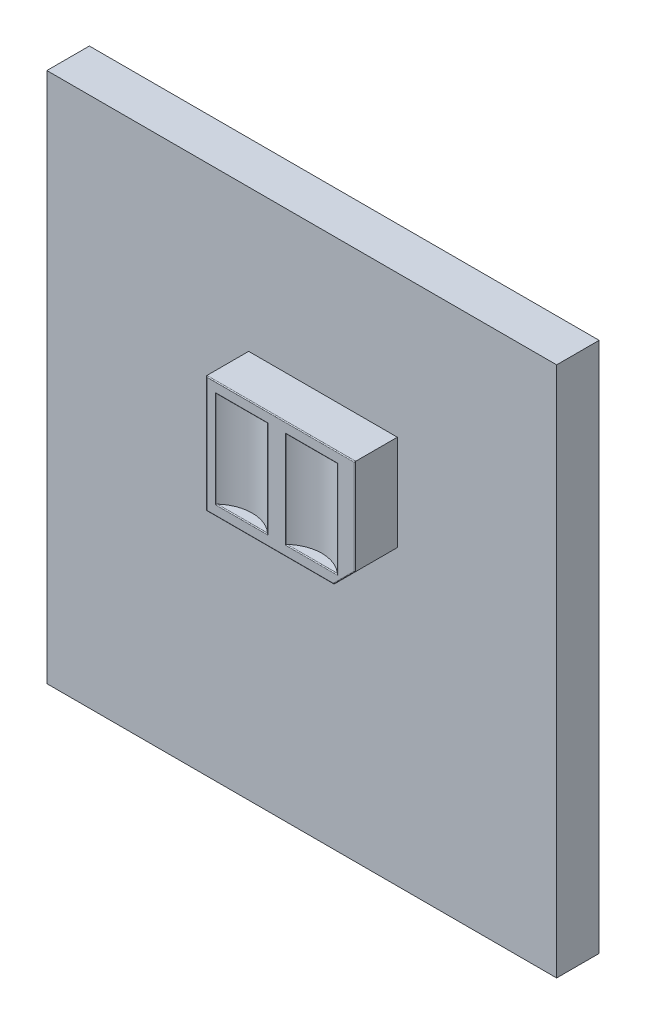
ISO-10303-21;
HEADER;
FILE_DESCRIPTION(('STEP AP214'),'2;1');
FILE_NAME('part.step','',(''),(''),'','','');
FILE_SCHEMA(('AUTOMOTIVE_DESIGN { 1 0 10303 214 1 1 1 1 }'));
ENDSEC;
DATA;
#1=APPLICATION_CONTEXT('core data for automotive mechanical design processes');
#2=APPLICATION_PROTOCOL_DEFINITION('international standard','automotive_design',2000,#1);
#3=PRODUCT_CONTEXT('',#1,'mechanical');
#4=PRODUCT('Part','Part','',(#3));
#5=PRODUCT_RELATED_PRODUCT_CATEGORY('part','',(#4));
#6=PRODUCT_DEFINITION_FORMATION('','',#4);
#7=PRODUCT_DEFINITION_CONTEXT('part definition',#1,'design');
#8=PRODUCT_DEFINITION('design','',#6,#7);
#9=PRODUCT_DEFINITION_SHAPE('','',#8);
#10=(LENGTH_UNIT() NAMED_UNIT(*) SI_UNIT(.MILLI.,.METRE.));
#11=(NAMED_UNIT(*) PLANE_ANGLE_UNIT() SI_UNIT($,.RADIAN.));
#12=(NAMED_UNIT(*) SI_UNIT($,.STERADIAN.) SOLID_ANGLE_UNIT());
#13=UNCERTAINTY_MEASURE_WITH_UNIT(LENGTH_MEASURE(1.E-05),#10,'distance_accuracy_value','');
#14=(GEOMETRIC_REPRESENTATION_CONTEXT(3) GLOBAL_UNCERTAINTY_ASSIGNED_CONTEXT((#13)) GLOBAL_UNIT_ASSIGNED_CONTEXT((#10,
#11,#12)) REPRESENTATION_CONTEXT('',''));
#15=CARTESIAN_POINT('',(0.,0.,0.));
#16=DIRECTION('',(0.,0.,1.));
#17=DIRECTION('',(1.,0.,0.));
#18=AXIS2_PLACEMENT_3D('',#15,#16,#17);
#19=CARTESIAN_POINT('',(-1.25,2.9,2.));
#20=DIRECTION('',(0.,0.,-1.));
#21=DIRECTION('',(-1.,0.,0.));
#22=AXIS2_PLACEMENT_3D('',#19,#20,#21);
#23=PLANE('',#22);
#24=DIRECTION('',(-1.,0.,0.));
#25=VECTOR('',#24,1.);
#26=CARTESIAN_POINT('',(-1.25,0.379999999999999,2.));
#27=LINE('',#26,#25);
#28=CARTESIAN_POINT('',(1.84761869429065,0.379999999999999,2.));
#29=VERTEX_POINT('',#28);
#30=CARTESIAN_POINT('',(0.611456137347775,0.379999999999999,2.));
#31=VERTEX_POINT('',#30);
#32=EDGE_CURVE('E286',#29,#31,#27,.T.);
#33=ORIENTED_EDGE('',*,*,#32,.T.);
#34=DIRECTION('',(0.,-1.,0.));
#35=VECTOR('',#34,1.);
#36=CARTESIAN_POINT('',(0.611456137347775,2.9,2.));
#37=LINE('',#36,#35);
#38=CARTESIAN_POINT('',(0.611456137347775,2.67,2.));
#39=VERTEX_POINT('',#38);
#40=EDGE_CURVE('E288',#31,#39,#37,.F.);
#41=ORIENTED_EDGE('',*,*,#40,.T.);
#42=DIRECTION('',(-1.,0.,0.));
#43=VECTOR('',#42,1.);
#44=CARTESIAN_POINT('',(1.83964288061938,2.67,2.));
#45=LINE('',#44,#43);
#46=CARTESIAN_POINT('',(1.84761869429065,2.67,2.));
#47=VERTEX_POINT('',#46);
#48=EDGE_CURVE('E282',#39,#47,#45,.F.);
#49=ORIENTED_EDGE('',*,*,#48,.T.);
#50=DIRECTION('',(0.,-1.,0.));
#51=VECTOR('',#50,1.);
#52=CARTESIAN_POINT('',(1.84761869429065,2.9,2.));
#53=LINE('',#52,#51);
#54=EDGE_CURVE('E284',#47,#29,#53,.T.);
#55=ORIENTED_EDGE('',*,*,#54,.T.);
#56=EDGE_LOOP('',(#33,#41,#49,#55));
#57=FACE_BOUND('',#56,.T.);
#58=DIRECTION('',(0.,1.,0.));
#59=VECTOR('',#58,1.);
#60=CARTESIAN_POINT('',(2.23,2.9,2.));
#61=LINE('',#60,#59);
#62=CARTESIAN_POINT('',(2.23,0.658284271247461,2.));
#63=VERTEX_POINT('',#62);
#64=CARTESIAN_POINT('',(2.23,2.88,2.));
#65=VERTEX_POINT('',#64);
#66=EDGE_CURVE('E277',#63,#65,#61,.T.);
#67=ORIENTED_EDGE('',*,*,#66,.T.);
#68=DIRECTION('',(-1.,0.,0.));
#69=VECTOR('',#68,1.);
#70=CARTESIAN_POINT('',(-1.25,2.88,2.));
#71=LINE('',#70,#69);
#72=CARTESIAN_POINT('',(-1.23,2.88,2.));
#73=VERTEX_POINT('',#72);
#74=EDGE_CURVE('E279',#65,#73,#71,.T.);
#75=ORIENTED_EDGE('',*,*,#74,.T.);
#76=DIRECTION('',(0.,-1.,0.));
#77=VECTOR('',#76,1.);
#78=CARTESIAN_POINT('',(-1.23,2.9,2.));
#79=LINE('',#78,#77);
#80=CARTESIAN_POINT('',(-1.23,0.169999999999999,2.));
#81=VERTEX_POINT('',#80);
#82=EDGE_CURVE('E271',#73,#81,#79,.T.);
#83=ORIENTED_EDGE('',*,*,#82,.T.);
#84=DIRECTION('',(1.,0.,0.));
#85=VECTOR('',#84,1.);
#86=CARTESIAN_POINT('',(-1.25,0.169999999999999,2.));
#87=LINE('',#86,#85);
#88=CARTESIAN_POINT('',(1.74171572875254,0.17,2.));
#89=VERTEX_POINT('',#88);
#90=EDGE_CURVE('E273',#81,#89,#87,.T.);
#91=ORIENTED_EDGE('',*,*,#90,.T.);
#92=DIRECTION('',(0.707106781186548,0.707106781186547,0.));
#93=VECTOR('',#92,1.);
#94=CARTESIAN_POINT('',(1.61085786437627,0.0391421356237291,2.));
#95=LINE('',#94,#93);
#96=EDGE_CURVE('E275',#89,#63,#95,.T.);
#97=ORIENTED_EDGE('',*,*,#96,.T.);
#98=EDGE_LOOP('',(#67,#75,#83,#91,#97));
#99=FACE_BOUND('',#98,.T.);
#100=DIRECTION('',(0.,-1.,0.));
#101=VECTOR('',#100,1.);
#102=CARTESIAN_POINT('',(0.205356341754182,2.9,2.));
#103=LINE('',#102,#101);
#104=CARTESIAN_POINT('',(0.205356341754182,2.67,2.));
#105=VERTEX_POINT('',#104);
#106=CARTESIAN_POINT('',(0.205356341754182,0.379999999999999,2.));
#107=VERTEX_POINT('',#106);
#108=EDGE_CURVE('E266',#105,#107,#103,.T.);
#109=ORIENTED_EDGE('',*,*,#108,.T.);
#110=DIRECTION('',(-1.,0.,0.));
#111=VECTOR('',#110,1.);
#112=CARTESIAN_POINT('',(-1.02283040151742,0.379999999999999,2.));
#113=LINE('',#112,#111);
#114=CARTESIAN_POINT('',(-1.03080621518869,0.379999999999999,2.));
#115=VERTEX_POINT('',#114);
#116=EDGE_CURVE('E268',#107,#115,#113,.T.);
#117=ORIENTED_EDGE('',*,*,#116,.T.);
#118=DIRECTION('',(0.,-1.,0.));
#119=VECTOR('',#118,1.);
#120=CARTESIAN_POINT('',(-1.03080621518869,2.9,2.));
#121=LINE('',#120,#119);
#122=CARTESIAN_POINT('',(-1.03080621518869,2.67,2.));
#123=VERTEX_POINT('',#122);
#124=EDGE_CURVE('E262',#115,#123,#121,.F.);
#125=ORIENTED_EDGE('',*,*,#124,.T.);
#126=DIRECTION('',(-1.,0.,0.));
#127=VECTOR('',#126,1.);
#128=CARTESIAN_POINT('',(-1.25,2.67,2.));
#129=LINE('',#128,#127);
#130=EDGE_CURVE('E264',#123,#105,#129,.F.);
#131=ORIENTED_EDGE('',*,*,#130,.T.);
#132=EDGE_LOOP('',(#109,#117,#125,#131));
#133=FACE_BOUND('',#132,.T.);
#134=ADVANCED_FACE('F31',(#57,#99,#133),#23,.F.);
#135=CARTESIAN_POINT('',(-6.,6.25,1.));
#136=DIRECTION('',(0.,0.,1.));
#137=DIRECTION('',(1.,0.,0.));
#138=AXIS2_PLACEMENT_3D('',#135,#136,#137);
#139=PLANE('',#138);
#140=DIRECTION('',(0.,-1.,0.));
#141=VECTOR('',#140,1.);
#142=CARTESIAN_POINT('',(-6.,6.25,1.));
#143=LINE('',#142,#141);
#144=CARTESIAN_POINT('',(-6.,6.25,1.));
#145=VERTEX_POINT('',#144);
#146=CARTESIAN_POINT('',(-6.,-6.25,1.));
#147=VERTEX_POINT('',#146);
#148=EDGE_CURVE('E237',#145,#147,#143,.T.);
#149=ORIENTED_EDGE('',*,*,#148,.T.);
#150=DIRECTION('',(1.,0.,0.));
#151=VECTOR('',#150,1.);
#152=CARTESIAN_POINT('',(-6.,-6.25,1.));
#153=LINE('',#152,#151);
#154=CARTESIAN_POINT('',(6.,-6.25,1.));
#155=VERTEX_POINT('',#154);
#156=EDGE_CURVE('E240',#147,#155,#153,.T.);
#157=ORIENTED_EDGE('',*,*,#156,.T.);
#158=DIRECTION('',(0.,1.,0.));
#159=VECTOR('',#158,1.);
#160=CARTESIAN_POINT('',(6.,6.25,1.));
#161=LINE('',#160,#159);
#162=CARTESIAN_POINT('',(6.,6.25,1.));
#163=VERTEX_POINT('',#162);
#164=EDGE_CURVE('E242',#155,#163,#161,.T.);
#165=ORIENTED_EDGE('',*,*,#164,.T.);
#166=DIRECTION('',(-1.,0.,0.));
#167=VECTOR('',#166,1.);
#168=CARTESIAN_POINT('',(-6.,6.25,1.));
#169=LINE('',#168,#167);
#170=EDGE_CURVE('E244',#163,#145,#169,.T.);
#171=ORIENTED_EDGE('',*,*,#170,.T.);
#172=EDGE_LOOP('',(#149,#157,#165,#171));
#173=FACE_BOUND('',#172,.T.);
#174=DIRECTION('',(-1.,0.,0.));
#175=VECTOR('',#174,1.);
#176=CARTESIAN_POINT('',(-6.,0.149999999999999,1.));
#177=LINE('',#176,#175);
#178=CARTESIAN_POINT('',(1.75,0.15,1.));
#179=VERTEX_POINT('',#178);
#180=CARTESIAN_POINT('',(-1.25,0.149999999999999,1.));
#181=VERTEX_POINT('',#180);
#182=EDGE_CURVE('E222',#179,#181,#177,.T.);
#183=ORIENTED_EDGE('',*,*,#182,.T.);
#184=DIRECTION('',(0.,1.,0.));
#185=VECTOR('',#184,1.);
#186=CARTESIAN_POINT('',(-1.25,6.25,1.));
#187=LINE('',#186,#185);
#188=CARTESIAN_POINT('',(-1.25,2.9,1.));
#189=VERTEX_POINT('',#188);
#190=EDGE_CURVE('E199',#181,#189,#187,.T.);
#191=ORIENTED_EDGE('',*,*,#190,.T.);
#192=DIRECTION('',(1.,0.,0.));
#193=VECTOR('',#192,1.);
#194=CARTESIAN_POINT('',(-6.,2.9,1.));
#195=LINE('',#194,#193);
#196=CARTESIAN_POINT('',(2.25,2.9,1.));
#197=VERTEX_POINT('',#196);
#198=EDGE_CURVE('E210',#189,#197,#195,.T.);
#199=ORIENTED_EDGE('',*,*,#198,.T.);
#200=DIRECTION('',(0.,-1.,0.));
#201=VECTOR('',#200,1.);
#202=CARTESIAN_POINT('',(2.25,6.25,1.));
#203=LINE('',#202,#201);
#204=CARTESIAN_POINT('',(2.25,0.65,1.));
#205=VERTEX_POINT('',#204);
#206=EDGE_CURVE('E216',#197,#205,#203,.T.);
#207=ORIENTED_EDGE('',*,*,#206,.T.);
#208=DIRECTION('',(-0.707106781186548,-0.707106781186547,0.));
#209=VECTOR('',#208,1.);
#210=CARTESIAN_POINT('',(0.925,-0.675000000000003,1.));
#211=LINE('',#210,#209);
#212=EDGE_CURVE('E228',#205,#179,#211,.T.);
#213=ORIENTED_EDGE('',*,*,#212,.T.);
#214=EDGE_LOOP('',(#183,#191,#199,#207,#213));
#215=FACE_BOUND('',#214,.T.);
#216=ADVANCED_FACE('F219',(#173,#215),#139,.T.);
#217=CARTESIAN_POINT('',(-6.,6.25,1.));
#218=DIRECTION('',(1.,0.,0.));
#219=DIRECTION('',(0.,1.,0.));
#220=AXIS2_PLACEMENT_3D('',#217,#218,#219);
#221=PLANE('',#220);
#222=DIRECTION('',(0.,-1.,0.));
#223=VECTOR('',#222,1.);
#224=CARTESIAN_POINT('',(-6.,6.25,0.));
#225=LINE('',#224,#223);
#226=CARTESIAN_POINT('',(-6.,6.25,0.));
#227=VERTEX_POINT('',#226);
#228=CARTESIAN_POINT('',(-6.,-6.25,0.));
#229=VERTEX_POINT('',#228);
#230=EDGE_CURVE('E223',#227,#229,#225,.T.);
#231=ORIENTED_EDGE('',*,*,#230,.T.);
#232=DIRECTION('',(0.,0.,-1.));
#233=VECTOR('',#232,1.);
#234=CARTESIAN_POINT('',(-6.,-6.25,1.));
#235=LINE('',#234,#233);
#236=EDGE_CURVE('E255',#147,#229,#235,.T.);
#237=ORIENTED_EDGE('',*,*,#236,.F.);
#238=ORIENTED_EDGE('',*,*,#148,.F.);
#239=DIRECTION('',(0.,0.,-1.));
#240=VECTOR('',#239,1.);
#241=CARTESIAN_POINT('',(-6.,6.25,1.));
#242=LINE('',#241,#240);
#243=EDGE_CURVE('E246',#145,#227,#242,.T.);
#244=ORIENTED_EDGE('',*,*,#243,.T.);
#245=EDGE_LOOP('',(#231,#237,#238,#244));
#246=FACE_BOUND('',#245,.T.);
#247=ADVANCED_FACE('F33',(#246),#221,.F.);
#248=CARTESIAN_POINT('',(-6.,-6.25,1.));
#249=DIRECTION('',(0.,1.,0.));
#250=DIRECTION('',(0.,0.,1.));
#251=AXIS2_PLACEMENT_3D('',#248,#249,#250);
#252=PLANE('',#251);
#253=DIRECTION('',(1.,0.,0.));
#254=VECTOR('',#253,1.);
#255=CARTESIAN_POINT('',(-6.,-6.25,0.));
#256=LINE('',#255,#254);
#257=CARTESIAN_POINT('',(6.,-6.25,0.));
#258=VERTEX_POINT('',#257);
#259=EDGE_CURVE('E226',#229,#258,#256,.T.);
#260=ORIENTED_EDGE('',*,*,#259,.T.);
#261=DIRECTION('',(0.,0.,-1.));
#262=VECTOR('',#261,1.);
#263=CARTESIAN_POINT('',(6.,-6.25,1.));
#264=LINE('',#263,#262);
#265=EDGE_CURVE('E252',#155,#258,#264,.T.);
#266=ORIENTED_EDGE('',*,*,#265,.F.);
#267=ORIENTED_EDGE('',*,*,#156,.F.);
#268=ORIENTED_EDGE('',*,*,#236,.T.);
#269=EDGE_LOOP('',(#260,#266,#267,#268));
#270=FACE_BOUND('',#269,.T.);
#271=ADVANCED_FACE('F724',(#270),#252,.F.);
#272=CARTESIAN_POINT('',(6.,6.25,1.));
#273=DIRECTION('',(-1.,0.,0.));
#274=DIRECTION('',(0.,0.,1.));
#275=AXIS2_PLACEMENT_3D('',#272,#273,#274);
#276=PLANE('',#275);
#277=DIRECTION('',(0.,1.,0.));
#278=VECTOR('',#277,1.);
#279=CARTESIAN_POINT('',(6.,6.25,0.));
#280=LINE('',#279,#278);
#281=CARTESIAN_POINT('',(6.,6.25,0.));
#282=VERTEX_POINT('',#281);
#283=EDGE_CURVE('E233',#258,#282,#280,.T.);
#284=ORIENTED_EDGE('',*,*,#283,.T.);
#285=DIRECTION('',(0.,0.,-1.));
#286=VECTOR('',#285,1.);
#287=CARTESIAN_POINT('',(6.,6.25,1.));
#288=LINE('',#287,#286);
#289=EDGE_CURVE('E249',#163,#282,#288,.T.);
#290=ORIENTED_EDGE('',*,*,#289,.F.);
#291=ORIENTED_EDGE('',*,*,#164,.F.);
#292=ORIENTED_EDGE('',*,*,#265,.T.);
#293=EDGE_LOOP('',(#284,#290,#291,#292));
#294=FACE_BOUND('',#293,.T.);
#295=ADVANCED_FACE('F715',(#294),#276,.F.);
#296=CARTESIAN_POINT('',(-6.,6.25,1.));
#297=DIRECTION('',(0.,-1.,0.));
#298=DIRECTION('',(1.,0.,0.));
#299=AXIS2_PLACEMENT_3D('',#296,#297,#298);
#300=PLANE('',#299);
#301=DIRECTION('',(-1.,0.,0.));
#302=VECTOR('',#301,1.);
#303=CARTESIAN_POINT('',(-6.,6.25,0.));
#304=LINE('',#303,#302);
#305=EDGE_CURVE('E235',#282,#227,#304,.T.);
#306=ORIENTED_EDGE('',*,*,#305,.T.);
#307=ORIENTED_EDGE('',*,*,#243,.F.);
#308=ORIENTED_EDGE('',*,*,#170,.F.);
#309=ORIENTED_EDGE('',*,*,#289,.T.);
#310=EDGE_LOOP('',(#306,#307,#308,#309));
#311=FACE_BOUND('',#310,.T.);
#312=ADVANCED_FACE('F707',(#311),#300,.F.);
#313=CARTESIAN_POINT('',(-6.,6.25,0.));
#314=DIRECTION('',(0.,0.,1.));
#315=DIRECTION('',(1.,0.,0.));
#316=AXIS2_PLACEMENT_3D('',#313,#314,#315);
#317=PLANE('',#316);
#318=ORIENTED_EDGE('',*,*,#230,.F.);
#319=ORIENTED_EDGE('',*,*,#305,.F.);
#320=ORIENTED_EDGE('',*,*,#283,.F.);
#321=ORIENTED_EDGE('',*,*,#259,.F.);
#322=EDGE_LOOP('',(#318,#319,#320,#321));
#323=FACE_BOUND('',#322,.T.);
#324=ADVANCED_FACE('F691',(#323),#317,.F.);
#325=CARTESIAN_POINT('',(-1.25,0.149999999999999,2.));
#326=DIRECTION('',(1.,0.,0.));
#327=DIRECTION('',(0.,0.,-1.));
#328=AXIS2_PLACEMENT_3D('',#325,#326,#327);
#329=PLANE('',#328);
#330=DIRECTION('',(0.,0.,-1.));
#331=VECTOR('',#330,1.);
#332=CARTESIAN_POINT('',(-1.25,0.149999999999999,2.));
#333=LINE('',#332,#331);
#334=CARTESIAN_POINT('',(-1.25,0.149999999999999,1.98));
#335=VERTEX_POINT('',#334);
#336=EDGE_CURVE('E217',#335,#181,#333,.T.);
#337=ORIENTED_EDGE('',*,*,#336,.F.);
#338=DIRECTION('',(0.,-1.,0.));
#339=VECTOR('',#338,1.);
#340=CARTESIAN_POINT('',(-1.25,0.149999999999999,1.98));
#341=LINE('',#340,#339);
#342=CARTESIAN_POINT('',(-1.25,2.9,1.98));
#343=VERTEX_POINT('',#342);
#344=EDGE_CURVE('E202',#335,#343,#341,.F.);
#345=ORIENTED_EDGE('',*,*,#344,.T.);
#346=DIRECTION('',(0.,0.,-1.));
#347=VECTOR('',#346,1.);
#348=CARTESIAN_POINT('',(-1.25,2.9,2.));
#349=LINE('',#348,#347);
#350=EDGE_CURVE('E194',#343,#189,#349,.T.);
#351=ORIENTED_EDGE('',*,*,#350,.T.);
#352=ORIENTED_EDGE('',*,*,#190,.F.);
#353=EDGE_LOOP('',(#337,#345,#351,#352));
#354=FACE_BOUND('',#353,.T.);
#355=ADVANCED_FACE('F197',(#354),#329,.F.);
#356=CARTESIAN_POINT('',(1.75,0.15,2.));
#357=DIRECTION('',(0.,1.,0.));
#358=DIRECTION('',(-1.,0.,0.));
#359=AXIS2_PLACEMENT_3D('',#356,#357,#358);
#360=PLANE('',#359);
#361=DIRECTION('',(0.,0.,-1.));
#362=VECTOR('',#361,1.);
#363=CARTESIAN_POINT('',(1.75,0.15,2.));
#364=LINE('',#363,#362);
#365=CARTESIAN_POINT('',(1.75,0.15,1.98));
#366=VERTEX_POINT('',#365);
#367=EDGE_CURVE('E448',#366,#179,#364,.T.);
#368=ORIENTED_EDGE('',*,*,#367,.F.);
#369=DIRECTION('',(1.,0.,0.));
#370=VECTOR('',#369,1.);
#371=CARTESIAN_POINT('',(1.75,0.15,1.98));
#372=LINE('',#371,#370);
#373=EDGE_CURVE('E301',#366,#335,#372,.F.);
#374=ORIENTED_EDGE('',*,*,#373,.T.);
#375=ORIENTED_EDGE('',*,*,#336,.T.);
#376=ORIENTED_EDGE('',*,*,#182,.F.);
#377=EDGE_LOOP('',(#368,#374,#375,#376));
#378=FACE_BOUND('',#377,.T.);
#379=ADVANCED_FACE('F459',(#378),#360,.F.);
#380=CARTESIAN_POINT('',(2.25,0.65,2.));
#381=DIRECTION('',(-0.707106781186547,0.707106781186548,0.));
#382=DIRECTION('',(-0.707106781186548,-0.707106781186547,0.));
#383=AXIS2_PLACEMENT_3D('',#380,#381,#382);
#384=PLANE('',#383);
#385=DIRECTION('',(0.,0.,-1.));
#386=VECTOR('',#385,1.);
#387=CARTESIAN_POINT('',(2.25,0.65,2.));
#388=LINE('',#387,#386);
#389=CARTESIAN_POINT('',(2.25,0.65,1.98));
#390=VERTEX_POINT('',#389);
#391=EDGE_CURVE('E446',#390,#205,#388,.T.);
#392=ORIENTED_EDGE('',*,*,#391,.F.);
#393=DIRECTION('',(0.707106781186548,0.707106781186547,0.));
#394=VECTOR('',#393,1.);
#395=CARTESIAN_POINT('',(2.25,0.65,1.98));
#396=LINE('',#395,#394);
#397=EDGE_CURVE('E299',#390,#366,#396,.F.);
#398=ORIENTED_EDGE('',*,*,#397,.T.);
#399=ORIENTED_EDGE('',*,*,#367,.T.);
#400=ORIENTED_EDGE('',*,*,#212,.F.);
#401=EDGE_LOOP('',(#392,#398,#399,#400));
#402=FACE_BOUND('',#401,.T.);
#403=ADVANCED_FACE('F454',(#402),#384,.F.);
#404=CARTESIAN_POINT('',(2.25,2.9,2.));
#405=DIRECTION('',(-1.,0.,0.));
#406=DIRECTION('',(0.,-1.,0.));
#407=AXIS2_PLACEMENT_3D('',#404,#405,#406);
#408=PLANE('',#407);
#409=DIRECTION('',(0.,0.,-1.));
#410=VECTOR('',#409,1.);
#411=CARTESIAN_POINT('',(2.25,2.9,2.));
#412=LINE('',#411,#410);
#413=CARTESIAN_POINT('',(2.25,2.9,1.98));
#414=VERTEX_POINT('',#413);
#415=EDGE_CURVE('E206',#414,#197,#412,.T.);
#416=ORIENTED_EDGE('',*,*,#415,.F.);
#417=DIRECTION('',(0.,1.,0.));
#418=VECTOR('',#417,1.);
#419=CARTESIAN_POINT('',(2.25,2.9,1.98));
#420=LINE('',#419,#418);
#421=EDGE_CURVE('E297',#414,#390,#420,.F.);
#422=ORIENTED_EDGE('',*,*,#421,.T.);
#423=ORIENTED_EDGE('',*,*,#391,.T.);
#424=ORIENTED_EDGE('',*,*,#206,.F.);
#425=EDGE_LOOP('',(#416,#422,#423,#424));
#426=FACE_BOUND('',#425,.T.);
#427=ADVANCED_FACE('F474',(#426),#408,.F.);
#428=CARTESIAN_POINT('',(-1.25,2.9,2.));
#429=DIRECTION('',(0.,-1.,0.));
#430=DIRECTION('',(1.,0.,0.));
#431=AXIS2_PLACEMENT_3D('',#428,#429,#430);
#432=PLANE('',#431);
#433=ORIENTED_EDGE('',*,*,#350,.F.);
#434=DIRECTION('',(-1.,0.,0.));
#435=VECTOR('',#434,1.);
#436=CARTESIAN_POINT('',(-1.25,2.9,1.98));
#437=LINE('',#436,#435);
#438=EDGE_CURVE('E295',#343,#414,#437,.F.);
#439=ORIENTED_EDGE('',*,*,#438,.T.);
#440=ORIENTED_EDGE('',*,*,#415,.T.);
#441=ORIENTED_EDGE('',*,*,#198,.F.);
#442=EDGE_LOOP('',(#433,#439,#440,#441));
#443=FACE_BOUND('',#442,.T.);
#444=ADVANCED_FACE('F211',(#443),#432,.F.);
#445=CARTESIAN_POINT('',(1.22953741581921,2.65,2.63752959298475));
#446=DIRECTION('',(0.,-1.,0.));
#447=DIRECTION('',(0.,0.,-1.));
#448=AXIS2_PLACEMENT_3D('',#445,#446,#447);
#449=CYLINDRICAL_SURFACE('',#448,0.882424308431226);
#450=CARTESIAN_POINT('',(1.22953741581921,2.65,2.63752959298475));
#451=DIRECTION('',(0.,-1.,0.));
#452=DIRECTION('',(0.,0.,-1.));
#453=AXIS2_PLACEMENT_3D('',#450,#451,#452);
#454=CIRCLE('',#453,0.882424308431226);
#455=CARTESIAN_POINT('',(0.641041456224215,2.65,1.98));
#456=VERTEX_POINT('',#455);
#457=CARTESIAN_POINT('',(1.81803337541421,2.65,1.98));
#458=VERTEX_POINT('',#457);
#459=EDGE_CURVE('E207',#456,#458,#454,.T.);
#460=ORIENTED_EDGE('',*,*,#459,.F.);
#461=CARTESIAN_POINT('',(0.64104145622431,2.65,1.97999999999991));
#462=CARTESIAN_POINT('',(0.639229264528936,2.65000463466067,1.98162119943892));
#463=CARTESIAN_POINT('',(0.637414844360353,2.65019827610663,1.98325934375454));
#464=CARTESIAN_POINT('',(0.633907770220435,2.65099829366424,1.98645110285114));
#465=CARTESIAN_POINT('',(0.632213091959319,2.65159196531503,1.98800577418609));
#466=CARTESIAN_POINT('',(0.629625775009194,2.65288558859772,1.99039714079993));
#467=CARTESIAN_POINT('',(0.628690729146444,2.65344060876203,1.99126539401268));
#468=CARTESIAN_POINT('',(0.626871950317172,2.65473048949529,1.99296106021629));
#469=CARTESIAN_POINT('',(0.625989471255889,2.65546845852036,1.99378743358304));
#470=CARTESIAN_POINT('',(0.625154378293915,2.65630175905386,1.9945725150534));
#471=B_SPLINE_CURVE_WITH_KNOTS('',3,(#461,#462,#463,#464,#465,#466,#467,#468,#469,#470),
.UNSPECIFIED.,.F.,.F.,(4,2,2,2,4),(0.,0.00730858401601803,0.0143953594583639,0.0185579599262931,
0.0227968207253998),.UNSPECIFIED.);
#472=CARTESIAN_POINT('',(0.625154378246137,2.65630175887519,1.99457251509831));
#473=VERTEX_POINT('',#472);
#474=EDGE_CURVE('E344',#456,#473,#471,.T.);
#475=ORIENTED_EDGE('',*,*,#474,.T.);
#476=DIRECTION('',(0.,-1.,0.));
#477=VECTOR('',#476,1.);
#478=CARTESIAN_POINT('',(0.625154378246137,2.65,1.99457251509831));
#479=LINE('',#478,#477);
#480=CARTESIAN_POINT('',(0.625154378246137,0.393698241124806,1.99457251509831));
#481=VERTEX_POINT('',#480);
#482=EDGE_CURVE('E260',#473,#481,#479,.T.);
#483=ORIENTED_EDGE('',*,*,#482,.T.);
#484=CARTESIAN_POINT('',(0.625154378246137,0.393698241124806,1.99457251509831));
#485=CARTESIAN_POINT('',(0.626170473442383,0.394710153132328,1.99361714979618));
#486=CARTESIAN_POINT('',(0.627254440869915,0.395582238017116,1.99260297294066));
#487=CARTESIAN_POINT('',(0.629494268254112,0.397058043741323,1.99051869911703));
#488=CARTESIAN_POINT('',(0.630648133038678,0.397667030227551,1.98945022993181));
#489=CARTESIAN_POINT('',(0.633287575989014,0.398785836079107,1.98702000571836));
#490=CARTESIAN_POINT('',(0.634787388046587,0.399238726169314,1.98564833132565));
#491=CARTESIAN_POINT('',(0.637870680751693,0.399848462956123,1.98284822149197));
#492=CARTESIAN_POINT('',(0.639455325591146,0.3999971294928,1.98141924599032));
#493=CARTESIAN_POINT('',(0.641041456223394,0.400000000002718,1.98000000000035));
#494=B_SPLINE_CURVE_WITH_KNOTS('',3,(#484,#485,#486,#487,#488,#489,#490,#491,#492,#493),
.UNSPECIFIED.,.F.,.F.,(4,2,2,2,4),(0.,0.00514761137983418,0.0101867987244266,0.0164101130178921,
0.022798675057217),.UNSPECIFIED.);
#495=CARTESIAN_POINT('',(0.641041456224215,0.399999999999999,1.98));
#496=VERTEX_POINT('',#495);
#497=EDGE_CURVE('E311',#481,#496,#494,.T.);
#498=ORIENTED_EDGE('',*,*,#497,.T.);
#499=CARTESIAN_POINT('',(1.22953741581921,0.399999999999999,2.63752959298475));
#500=DIRECTION('',(0.,-1.,0.));
#501=DIRECTION('',(0.,0.,-1.));
#502=AXIS2_PLACEMENT_3D('',#499,#500,#501);
#503=CIRCLE('',#502,0.882424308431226);
#504=CARTESIAN_POINT('',(1.81803337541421,0.399999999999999,1.98));
#505=VERTEX_POINT('',#504);
#506=EDGE_CURVE('E440',#496,#505,#503,.T.);
#507=ORIENTED_EDGE('',*,*,#506,.T.);
#508=CARTESIAN_POINT('',(1.81803337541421,0.399999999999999,1.98));
#509=CARTESIAN_POINT('',(1.81984556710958,0.399995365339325,1.981621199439));
#510=CARTESIAN_POINT('',(1.82165998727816,0.399801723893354,1.98325934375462));
#511=CARTESIAN_POINT('',(1.82516706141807,0.39900170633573,1.98645110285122));
#512=CARTESIAN_POINT('',(1.82686173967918,0.39840803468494,1.98800577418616));
#513=CARTESIAN_POINT('',(1.82944905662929,0.397114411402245,1.99039714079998));
#514=CARTESIAN_POINT('',(1.83038410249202,0.396559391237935,1.99126539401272));
#515=CARTESIAN_POINT('',(1.83220288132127,0.395269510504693,1.99296106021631));
#516=CARTESIAN_POINT('',(1.83308536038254,0.394531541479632,1.99378743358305));
#517=CARTESIAN_POINT('',(1.83392045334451,0.393698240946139,1.9945725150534));
#518=B_SPLINE_CURVE_WITH_KNOTS('',3,(#508,#509,#510,#511,#512,#513,#514,#515,#516,#517),
.UNSPECIFIED.,.F.,.F.,(4,2,2,2,4),(0.,0.00730858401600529,0.0143953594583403,0.0185579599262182,
0.0227968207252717),.UNSPECIFIED.);
#519=CARTESIAN_POINT('',(1.83392045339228,0.393698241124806,1.99457251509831));
#520=VERTEX_POINT('',#519);
#521=EDGE_CURVE('E318',#505,#520,#518,.T.);
#522=ORIENTED_EDGE('',*,*,#521,.T.);
#523=DIRECTION('',(0.,-1.,0.));
#524=VECTOR('',#523,1.);
#525=CARTESIAN_POINT('',(1.83392045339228,2.65,1.99457251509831));
#526=LINE('',#525,#524);
#527=CARTESIAN_POINT('',(1.83392045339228,2.65630175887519,1.99457251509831));
#528=VERTEX_POINT('',#527);
#529=EDGE_CURVE('E258',#520,#528,#526,.F.);
#530=ORIENTED_EDGE('',*,*,#529,.T.);
#531=CARTESIAN_POINT('',(1.83392045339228,2.65630175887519,1.99457251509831));
#532=CARTESIAN_POINT('',(1.83290435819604,2.65528984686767,1.99361714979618));
#533=CARTESIAN_POINT('',(1.83182039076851,2.65441776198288,1.99260297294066));
#534=CARTESIAN_POINT('',(1.82958056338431,2.65294195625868,1.99051869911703));
#535=CARTESIAN_POINT('',(1.82842669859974,2.65233296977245,1.98945022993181));
#536=CARTESIAN_POINT('',(1.82578725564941,2.65121416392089,1.98702000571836));
#537=CARTESIAN_POINT('',(1.82428744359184,2.65076127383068,1.98564833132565));
#538=CARTESIAN_POINT('',(1.82120415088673,2.65015153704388,1.98284822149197));
#539=CARTESIAN_POINT('',(1.81961950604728,2.6500028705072,1.98141924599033));
#540=CARTESIAN_POINT('',(1.81803337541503,2.64999999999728,1.98000000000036));
#541=B_SPLINE_CURVE_WITH_KNOTS('',3,(#531,#532,#533,#534,#535,#536,#537,#538,#539,#540),
.UNSPECIFIED.,.F.,.F.,(4,2,2,2,4),(0.,0.00514761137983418,0.0101867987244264,0.0164101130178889,
0.0227986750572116),.UNSPECIFIED.);
#542=EDGE_CURVE('E349',#528,#458,#541,.T.);
#543=ORIENTED_EDGE('',*,*,#542,.T.);
#544=EDGE_LOOP('',(#460,#475,#483,#498,#507,#522,#530,#543));
#545=FACE_BOUND('',#544,.T.);
#546=ADVANCED_FACE('F323',(#545),#449,.F.);
#547=CARTESIAN_POINT('',(1.22953741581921,2.65,2.63752959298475));
#548=DIRECTION('',(0.,-1.,0.));
#549=DIRECTION('',(0.,0.,-1.));
#550=AXIS2_PLACEMENT_3D('',#547,#548,#549);
#551=PLANE('',#550);
#552=ORIENTED_EDGE('',*,*,#459,.T.);
#553=DIRECTION('',(-1.,0.,0.));
#554=VECTOR('',#553,1.);
#555=CARTESIAN_POINT('',(0.619431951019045,2.65,1.98));
#556=LINE('',#555,#554);
#557=EDGE_CURVE('E293',#458,#456,#556,.T.);
#558=ORIENTED_EDGE('',*,*,#557,.T.);
#559=EDGE_LOOP('',(#552,#558));
#560=FACE_BOUND('',#559,.T.);
#561=ADVANCED_FACE('F502',(#560),#551,.T.);
#562=CARTESIAN_POINT('',(1.22953741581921,0.399999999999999,2.63752959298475));
#563=DIRECTION('',(0.,-1.,0.));
#564=DIRECTION('',(0.,0.,-1.));
#565=AXIS2_PLACEMENT_3D('',#562,#563,#564);
#566=PLANE('',#565);
#567=ORIENTED_EDGE('',*,*,#506,.F.);
#568=DIRECTION('',(-1.,0.,0.));
#569=VECTOR('',#568,1.);
#570=CARTESIAN_POINT('',(1.22953741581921,0.399999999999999,1.98));
#571=LINE('',#570,#569);
#572=EDGE_CURVE('E291',#496,#505,#571,.F.);
#573=ORIENTED_EDGE('',*,*,#572,.T.);
#574=EDGE_LOOP('',(#567,#573));
#575=FACE_BOUND('',#574,.T.);
#576=ADVANCED_FACE('F498',(#575),#566,.F.);
#577=CARTESIAN_POINT('',(-0.412724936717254,2.65,2.63752959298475));
#578=DIRECTION('',(0.,-1.,0.));
#579=DIRECTION('',(0.,0.,-1.));
#580=AXIS2_PLACEMENT_3D('',#577,#578,#579);
#581=CYLINDRICAL_SURFACE('',#580,0.882424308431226);
#582=CARTESIAN_POINT('',(0.175771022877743,0.399999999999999,1.98));
#583=CARTESIAN_POINT('',(0.177583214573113,0.399995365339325,1.981621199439));
#584=CARTESIAN_POINT('',(0.179397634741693,0.399801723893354,1.98325934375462));
#585=CARTESIAN_POINT('',(0.182904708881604,0.39900170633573,1.98645110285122));
#586=CARTESIAN_POINT('',(0.184599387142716,0.398408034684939,1.98800577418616));
#587=CARTESIAN_POINT('',(0.187186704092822,0.397114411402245,1.99039714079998));
#588=CARTESIAN_POINT('',(0.188121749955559,0.396559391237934,1.99126539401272));
#589=CARTESIAN_POINT('',(0.189940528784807,0.395269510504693,1.99296106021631));
#590=CARTESIAN_POINT('',(0.190823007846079,0.394531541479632,1.99378743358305));
#591=CARTESIAN_POINT('',(0.191658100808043,0.393698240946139,1.9945725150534));
#592=B_SPLINE_CURVE_WITH_KNOTS('',3,(#582,#583,#584,#585,#586,#587,#588,#589,#590,#591),
.UNSPECIFIED.,.F.,.F.,(4,2,2,2,4),(0.,0.00730858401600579,0.0143953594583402,0.0185579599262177,
0.022796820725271),.UNSPECIFIED.);
#593=CARTESIAN_POINT('',(0.175771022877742,0.399999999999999,1.98));
#594=VERTEX_POINT('',#593);
#595=CARTESIAN_POINT('',(0.19165810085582,0.393698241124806,1.99457251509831));
#596=VERTEX_POINT('',#595);
#597=EDGE_CURVE('E360',#594,#596,#592,.T.);
#598=ORIENTED_EDGE('',*,*,#597,.T.);
#599=DIRECTION('',(0.,-1.,0.));
#600=VECTOR('',#599,1.);
#601=CARTESIAN_POINT('',(0.19165810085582,2.65,1.99457251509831));
#602=LINE('',#601,#600);
#603=CARTESIAN_POINT('',(0.19165810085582,2.65630175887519,1.99457251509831));
#604=VERTEX_POINT('',#603);
#605=EDGE_CURVE('E58',#596,#604,#602,.F.);
#606=ORIENTED_EDGE('',*,*,#605,.T.);
#607=CARTESIAN_POINT('',(0.19165810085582,2.65630175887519,1.99457251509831));
#608=CARTESIAN_POINT('',(0.190642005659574,2.65528984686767,1.99361714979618));
#609=CARTESIAN_POINT('',(0.189558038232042,2.65441776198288,1.99260297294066));
#610=CARTESIAN_POINT('',(0.187318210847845,2.65294195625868,1.99051869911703));
#611=CARTESIAN_POINT('',(0.186164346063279,2.65233296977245,1.98945022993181));
#612=CARTESIAN_POINT('',(0.183524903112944,2.65121416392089,1.98702000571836));
#613=CARTESIAN_POINT('',(0.182025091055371,2.65076127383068,1.98564833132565));
#614=CARTESIAN_POINT('',(0.178941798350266,2.65015153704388,1.98284822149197));
#615=CARTESIAN_POINT('',(0.177357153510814,2.6500028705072,1.98141924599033));
#616=CARTESIAN_POINT('',(0.175771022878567,2.64999999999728,1.98000000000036));
#617=B_SPLINE_CURVE_WITH_KNOTS('',3,(#607,#608,#609,#610,#611,#612,#613,#614,#615,#616),
.UNSPECIFIED.,.F.,.F.,(4,2,2,2,4),(0.,0.00514761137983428,0.0101867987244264,0.0164101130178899,
0.0227986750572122),.UNSPECIFIED.);
#618=CARTESIAN_POINT('',(0.175771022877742,2.65,1.98));
#619=VERTEX_POINT('',#618);
#620=EDGE_CURVE('E11',#604,#619,#617,.T.);
#621=ORIENTED_EDGE('',*,*,#620,.T.);
#622=CARTESIAN_POINT('',(-0.412724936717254,2.65,2.63752959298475));
#623=DIRECTION('',(0.,-1.,0.));
#624=DIRECTION('',(0.,0.,1.));
#625=AXIS2_PLACEMENT_3D('',#622,#623,#624);
#626=CIRCLE('',#625,0.882424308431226);
#627=CARTESIAN_POINT('',(-1.00122089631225,2.65,1.98));
#628=VERTEX_POINT('',#627);
#629=EDGE_CURVE('E437',#628,#619,#626,.T.);
#630=ORIENTED_EDGE('',*,*,#629,.F.);
#631=CARTESIAN_POINT('',(-1.00122089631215,2.65,1.97999999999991));
#632=CARTESIAN_POINT('',(-1.00303308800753,2.65000463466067,1.98162119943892));
#633=CARTESIAN_POINT('',(-1.00484750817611,2.65019827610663,1.98325934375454));
#634=CARTESIAN_POINT('',(-1.00835458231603,2.65099829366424,1.98645110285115));
#635=CARTESIAN_POINT('',(-1.01004926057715,2.65159196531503,1.98800577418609));
#636=CARTESIAN_POINT('',(-1.01263657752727,2.65288558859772,1.99039714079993));
#637=CARTESIAN_POINT('',(-1.01357162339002,2.65344060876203,1.99126539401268));
#638=CARTESIAN_POINT('',(-1.01539040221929,2.65473048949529,1.99296106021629));
#639=CARTESIAN_POINT('',(-1.01627288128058,2.65546845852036,1.99378743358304));
#640=CARTESIAN_POINT('',(-1.01710797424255,2.65630175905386,1.9945725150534));
#641=B_SPLINE_CURVE_WITH_KNOTS('',3,(#631,#632,#633,#634,#635,#636,#637,#638,#639,#640),
.UNSPECIFIED.,.F.,.F.,(4,2,2,2,4),(0.,0.00730858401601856,0.0143953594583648,0.0185579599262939,
0.0227968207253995),.UNSPECIFIED.);
#642=CARTESIAN_POINT('',(-1.01710797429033,2.65630175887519,1.99457251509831));
#643=VERTEX_POINT('',#642);
#644=EDGE_CURVE('E44',#628,#643,#641,.T.);
#645=ORIENTED_EDGE('',*,*,#644,.T.);
#646=DIRECTION('',(0.,-1.,0.));
#647=VECTOR('',#646,1.);
#648=CARTESIAN_POINT('',(-1.01710797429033,2.65,1.99457251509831));
#649=LINE('',#648,#647);
#650=CARTESIAN_POINT('',(-1.01710797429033,0.393698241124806,1.99457251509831));
#651=VERTEX_POINT('',#650);
#652=EDGE_CURVE('E51',#643,#651,#649,.T.);
#653=ORIENTED_EDGE('',*,*,#652,.T.);
#654=CARTESIAN_POINT('',(-1.01710797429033,0.393698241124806,1.99457251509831));
#655=CARTESIAN_POINT('',(-1.01609187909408,0.394710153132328,1.99361714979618));
#656=CARTESIAN_POINT('',(-1.01500791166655,0.395582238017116,1.99260297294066));
#657=CARTESIAN_POINT('',(-1.01276808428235,0.397058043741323,1.99051869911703));
#658=CARTESIAN_POINT('',(-1.01161421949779,0.397667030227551,1.98945022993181));
#659=CARTESIAN_POINT('',(-1.00897477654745,0.398785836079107,1.98702000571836));
#660=CARTESIAN_POINT('',(-1.00747496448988,0.399238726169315,1.98564833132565));
#661=CARTESIAN_POINT('',(-1.00439167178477,0.399848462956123,1.98284822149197));
#662=CARTESIAN_POINT('',(-1.00280702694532,0.3999971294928,1.98141924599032));
#663=CARTESIAN_POINT('',(-1.00122089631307,0.400000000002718,1.98000000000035));
#664=B_SPLINE_CURVE_WITH_KNOTS('',3,(#654,#655,#656,#657,#658,#659,#660,#661,#662,#663),
.UNSPECIFIED.,.F.,.F.,(4,2,2,2,4),(0.,0.00514761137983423,0.0101867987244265,0.0164101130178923,
0.0227986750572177),.UNSPECIFIED.);
#665=CARTESIAN_POINT('',(-1.00122089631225,0.399999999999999,1.98));
#666=VERTEX_POINT('',#665);
#667=EDGE_CURVE('E354',#651,#666,#664,.T.);
#668=ORIENTED_EDGE('',*,*,#667,.T.);
#669=CARTESIAN_POINT('',(-0.412724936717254,0.399999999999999,2.63752959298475));
#670=DIRECTION('',(0.,-1.,0.));
#671=DIRECTION('',(0.,0.,1.));
#672=AXIS2_PLACEMENT_3D('',#669,#670,#671);
#673=CIRCLE('',#672,0.882424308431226);
#674=EDGE_CURVE('E397',#666,#594,#673,.T.);
#675=ORIENTED_EDGE('',*,*,#674,.T.);
#676=EDGE_LOOP('',(#598,#606,#621,#630,#645,#653,#668,#675));
#677=FACE_BOUND('',#676,.T.);
#678=ADVANCED_FACE('F364',(#677),#581,.F.);
#679=CARTESIAN_POINT('',(-0.412724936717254,2.65,2.63752959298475));
#680=DIRECTION('',(0.,1.,0.));
#681=DIRECTION('',(0.,0.,1.));
#682=AXIS2_PLACEMENT_3D('',#679,#680,#681);
#683=PLANE('',#682);
#684=ORIENTED_EDGE('',*,*,#629,.T.);
#685=DIRECTION('',(-1.,0.,0.));
#686=VECTOR('',#685,1.);
#687=CARTESIAN_POINT('',(-0.412724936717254,2.65,1.98));
#688=LINE('',#687,#686);
#689=EDGE_CURVE('E309',#619,#628,#688,.T.);
#690=ORIENTED_EDGE('',*,*,#689,.T.);
#691=EDGE_LOOP('',(#684,#690));
#692=FACE_BOUND('',#691,.T.);
#693=ADVANCED_FACE('F490',(#692),#683,.F.);
#694=CARTESIAN_POINT('',(-0.412724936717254,0.399999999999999,2.63752959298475));
#695=DIRECTION('',(0.,1.,0.));
#696=DIRECTION('',(0.,0.,1.));
#697=AXIS2_PLACEMENT_3D('',#694,#695,#696);
#698=PLANE('',#697);
#699=ORIENTED_EDGE('',*,*,#674,.F.);
#700=DIRECTION('',(-1.,0.,0.));
#701=VECTOR('',#700,1.);
#702=CARTESIAN_POINT('',(0.197380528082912,0.399999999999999,1.98));
#703=LINE('',#702,#701);
#704=EDGE_CURVE('E304',#666,#594,#703,.F.);
#705=ORIENTED_EDGE('',*,*,#704,.T.);
#706=EDGE_LOOP('',(#699,#705));
#707=FACE_BOUND('',#706,.T.);
#708=ADVANCED_FACE('F492',(#707),#698,.T.);
#709=CARTESIAN_POINT('',(1.84761869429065,2.65,1.98));
#710=DIRECTION('',(0.,-1.,0.));
#711=DIRECTION('',(0.,0.,-1.));
#712=AXIS2_PLACEMENT_3D('',#709,#710,#711);
#713=CYLINDRICAL_SURFACE('',#712,0.02);
#714=CARTESIAN_POINT('',(1.84761869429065,0.379999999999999,1.98));
#715=DIRECTION('',(-0.707106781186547,-0.707106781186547,0.));
#716=DIRECTION('',(-0.707106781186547,0.707106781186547,0.));
#717=AXIS2_PLACEMENT_3D('',#714,#715,#716);
#718=ELLIPSE('',#717,0.0282842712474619,0.02);
#719=EDGE_CURVE('E430',#29,#520,#718,.T.);
#720=ORIENTED_EDGE('',*,*,#719,.F.);
#721=ORIENTED_EDGE('',*,*,#54,.F.);
#722=CARTESIAN_POINT('',(1.84761869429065,2.67,1.98));
#723=DIRECTION('',(0.707106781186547,-0.707106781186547,0.));
#724=DIRECTION('',(-0.707106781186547,-0.707106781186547,0.));
#725=AXIS2_PLACEMENT_3D('',#722,#723,#724);
#726=ELLIPSE('',#725,0.0282842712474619,0.02);
#727=EDGE_CURVE('E433',#528,#47,#726,.F.);
#728=ORIENTED_EDGE('',*,*,#727,.F.);
#729=ORIENTED_EDGE('',*,*,#529,.F.);
#730=EDGE_LOOP('',(#720,#721,#728,#729));
#731=FACE_BOUND('',#730,.T.);
#732=ADVANCED_FACE('F340',(#731),#713,.T.);
#733=CARTESIAN_POINT('',(1.22953741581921,2.67,1.98));
#734=DIRECTION('',(1.,0.,0.));
#735=DIRECTION('',(0.,0.,-1.));
#736=AXIS2_PLACEMENT_3D('',#733,#734,#735);
#737=CYLINDRICAL_SURFACE('',#736,0.02);
#738=ORIENTED_EDGE('',*,*,#727,.T.);
#739=ORIENTED_EDGE('',*,*,#48,.F.);
#740=CARTESIAN_POINT('',(0.611456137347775,2.67,1.98));
#741=DIRECTION('',(-0.707106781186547,-0.707106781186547,0.));
#742=DIRECTION('',(0.707106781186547,-0.707106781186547,0.));
#743=AXIS2_PLACEMENT_3D('',#740,#741,#742);
#744=ELLIPSE('',#743,0.0282842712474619,0.02);
#745=EDGE_CURVE('E428',#473,#39,#744,.T.);
#746=ORIENTED_EDGE('',*,*,#745,.F.);
#747=ORIENTED_EDGE('',*,*,#474,.F.);
#748=ORIENTED_EDGE('',*,*,#557,.F.);
#749=ORIENTED_EDGE('',*,*,#542,.F.);
#750=EDGE_LOOP('',(#738,#739,#746,#747,#748,#749));
#751=FACE_BOUND('',#750,.T.);
#752=ADVANCED_FACE('F333',(#751),#737,.T.);
#753=CARTESIAN_POINT('',(-1.25,0.379999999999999,1.98));
#754=DIRECTION('',(-1.,0.,0.));
#755=DIRECTION('',(0.,0.,1.));
#756=AXIS2_PLACEMENT_3D('',#753,#754,#755);
#757=CYLINDRICAL_SURFACE('',#756,0.02);
#758=ORIENTED_EDGE('',*,*,#572,.F.);
#759=ORIENTED_EDGE('',*,*,#497,.F.);
#760=CARTESIAN_POINT('',(0.611456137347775,0.379999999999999,1.98));
#761=DIRECTION('',(0.707106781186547,-0.707106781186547,0.));
#762=DIRECTION('',(-0.707106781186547,-0.707106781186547,0.));
#763=AXIS2_PLACEMENT_3D('',#760,#761,#762);
#764=ELLIPSE('',#763,0.0282842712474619,0.02);
#765=EDGE_CURVE('E425',#31,#481,#764,.F.);
#766=ORIENTED_EDGE('',*,*,#765,.F.);
#767=ORIENTED_EDGE('',*,*,#32,.F.);
#768=ORIENTED_EDGE('',*,*,#719,.T.);
#769=ORIENTED_EDGE('',*,*,#521,.F.);
#770=EDGE_LOOP('',(#758,#759,#766,#767,#768,#769));
#771=FACE_BOUND('',#770,.T.);
#772=ADVANCED_FACE('F327',(#771),#757,.T.);
#773=CARTESIAN_POINT('',(0.611456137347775,2.65,1.98));
#774=DIRECTION('',(0.,-1.,0.));
#775=DIRECTION('',(0.,0.,-1.));
#776=AXIS2_PLACEMENT_3D('',#773,#774,#775);
#777=CYLINDRICAL_SURFACE('',#776,0.02);
#778=ORIENTED_EDGE('',*,*,#745,.T.);
#779=ORIENTED_EDGE('',*,*,#40,.F.);
#780=ORIENTED_EDGE('',*,*,#765,.T.);
#781=ORIENTED_EDGE('',*,*,#482,.F.);
#782=EDGE_LOOP('',(#778,#779,#780,#781));
#783=FACE_BOUND('',#782,.T.);
#784=ADVANCED_FACE('F332',(#783),#777,.T.);
#785=CARTESIAN_POINT('',(1.61085786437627,0.0391421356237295,1.98));
#786=DIRECTION('',(0.707106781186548,0.707106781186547,0.));
#787=DIRECTION('',(-0.707106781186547,0.707106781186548,0.));
#788=AXIS2_PLACEMENT_3D('',#785,#786,#787);
#789=CYLINDRICAL_SURFACE('',#788,0.02);
#790=CARTESIAN_POINT('',(2.23,0.658284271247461,1.98));
#791=DIRECTION('',(0.38268343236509,0.923879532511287,0.));
#792=DIRECTION('',(0.923879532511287,-0.38268343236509,0.));
#793=AXIS2_PLACEMENT_3D('',#790,#791,#792);
#794=ELLIPSE('',#793,0.0216478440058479,0.02);
#795=EDGE_CURVE('E419',#63,#390,#794,.T.);
#796=ORIENTED_EDGE('',*,*,#795,.F.);
#797=ORIENTED_EDGE('',*,*,#96,.F.);
#798=CARTESIAN_POINT('',(1.74171572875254,0.169999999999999,1.98));
#799=DIRECTION('',(0.923879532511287,0.38268343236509,0.));
#800=DIRECTION('',(0.38268343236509,-0.923879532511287,0.));
#801=AXIS2_PLACEMENT_3D('',#798,#799,#800);
#802=ELLIPSE('',#801,0.0216478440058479,0.02);
#803=EDGE_CURVE('E422',#366,#89,#802,.F.);
#804=ORIENTED_EDGE('',*,*,#803,.F.);
#805=ORIENTED_EDGE('',*,*,#397,.F.);
#806=EDGE_LOOP('',(#796,#797,#804,#805));
#807=FACE_BOUND('',#806,.T.);
#808=ADVANCED_FACE('F481',(#807),#789,.T.);
#809=CARTESIAN_POINT('',(-1.25,0.169999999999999,1.98));
#810=DIRECTION('',(1.,0.,0.));
#811=DIRECTION('',(0.,1.,0.));
#812=AXIS2_PLACEMENT_3D('',#809,#810,#811);
#813=CYLINDRICAL_SURFACE('',#812,0.02);
#814=ORIENTED_EDGE('',*,*,#803,.T.);
#815=ORIENTED_EDGE('',*,*,#90,.F.);
#816=CARTESIAN_POINT('',(-1.23,0.169999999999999,1.98));
#817=DIRECTION('',(0.707106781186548,-0.707106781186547,0.));
#818=DIRECTION('',(-0.707106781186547,-0.707106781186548,0.));
#819=AXIS2_PLACEMENT_3D('',#816,#817,#818);
#820=ELLIPSE('',#819,0.0282842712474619,0.02);
#821=EDGE_CURVE('E416',#335,#81,#820,.F.);
#822=ORIENTED_EDGE('',*,*,#821,.F.);
#823=ORIENTED_EDGE('',*,*,#373,.F.);
#824=EDGE_LOOP('',(#814,#815,#822,#823));
#825=FACE_BOUND('',#824,.T.);
#826=ADVANCED_FACE('F464',(#825),#813,.T.);
#827=CARTESIAN_POINT('',(2.23,2.9,1.98));
#828=DIRECTION('',(0.,1.,0.));
#829=DIRECTION('',(-1.,0.,0.));
#830=AXIS2_PLACEMENT_3D('',#827,#828,#829);
#831=CYLINDRICAL_SURFACE('',#830,0.02);
#832=ORIENTED_EDGE('',*,*,#795,.T.);
#833=ORIENTED_EDGE('',*,*,#421,.F.);
#834=CARTESIAN_POINT('',(2.23,2.88,1.98));
#835=DIRECTION('',(-0.707106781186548,0.707106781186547,0.));
#836=DIRECTION('',(0.707106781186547,0.707106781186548,0.));
#837=AXIS2_PLACEMENT_3D('',#834,#835,#836);
#838=ELLIPSE('',#837,0.0282842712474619,0.02);
#839=EDGE_CURVE('E414',#65,#414,#838,.T.);
#840=ORIENTED_EDGE('',*,*,#839,.F.);
#841=ORIENTED_EDGE('',*,*,#66,.F.);
#842=EDGE_LOOP('',(#832,#833,#840,#841));
#843=FACE_BOUND('',#842,.T.);
#844=ADVANCED_FACE('F476',(#843),#831,.T.);
#845=CARTESIAN_POINT('',(-1.23,2.9,1.98));
#846=DIRECTION('',(0.,-1.,0.));
#847=DIRECTION('',(0.,0.,-1.));
#848=AXIS2_PLACEMENT_3D('',#845,#846,#847);
#849=CYLINDRICAL_SURFACE('',#848,0.02);
#850=ORIENTED_EDGE('',*,*,#821,.T.);
#851=ORIENTED_EDGE('',*,*,#82,.F.);
#852=CARTESIAN_POINT('',(-1.23,2.88,1.98));
#853=DIRECTION('',(-0.707106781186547,-0.707106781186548,0.));
#854=DIRECTION('',(0.707106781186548,-0.707106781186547,0.));
#855=AXIS2_PLACEMENT_3D('',#852,#853,#854);
#856=ELLIPSE('',#855,0.0282842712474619,0.02);
#857=EDGE_CURVE('E412',#343,#73,#856,.F.);
#858=ORIENTED_EDGE('',*,*,#857,.F.);
#859=ORIENTED_EDGE('',*,*,#344,.F.);
#860=EDGE_LOOP('',(#850,#851,#858,#859));
#861=FACE_BOUND('',#860,.T.);
#862=ADVANCED_FACE('F468',(#861),#849,.T.);
#863=CARTESIAN_POINT('',(-1.25,2.88,1.98));
#864=DIRECTION('',(-1.,0.,0.));
#865=DIRECTION('',(0.,-1.,0.));
#866=AXIS2_PLACEMENT_3D('',#863,#864,#865);
#867=CYLINDRICAL_SURFACE('',#866,0.02);
#868=ORIENTED_EDGE('',*,*,#839,.T.);
#869=ORIENTED_EDGE('',*,*,#438,.F.);
#870=ORIENTED_EDGE('',*,*,#857,.T.);
#871=ORIENTED_EDGE('',*,*,#74,.F.);
#872=EDGE_LOOP('',(#868,#869,#870,#871));
#873=FACE_BOUND('',#872,.T.);
#874=ADVANCED_FACE('F384',(#873),#867,.T.);
#875=CARTESIAN_POINT('',(-0.412724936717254,2.67,1.98));
#876=DIRECTION('',(-1.,0.,0.));
#877=DIRECTION('',(0.,0.,1.));
#878=AXIS2_PLACEMENT_3D('',#875,#876,#877);
#879=CYLINDRICAL_SURFACE('',#878,0.02);
#880=ORIENTED_EDGE('',*,*,#689,.F.);
#881=ORIENTED_EDGE('',*,*,#620,.F.);
#882=CARTESIAN_POINT('',(0.205356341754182,2.67,1.98));
#883=DIRECTION('',(0.707106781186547,-0.707106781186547,0.));
#884=DIRECTION('',(-0.707106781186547,-0.707106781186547,0.));
#885=AXIS2_PLACEMENT_3D('',#882,#883,#884);
#886=ELLIPSE('',#885,0.0282842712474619,0.02);
#887=EDGE_CURVE('E406',#105,#604,#886,.T.);
#888=ORIENTED_EDGE('',*,*,#887,.F.);
#889=ORIENTED_EDGE('',*,*,#130,.F.);
#890=CARTESIAN_POINT('',(-1.03080621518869,2.67,1.98));
#891=DIRECTION('',(-0.707106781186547,-0.707106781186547,0.));
#892=DIRECTION('',(-0.707106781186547,0.707106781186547,0.));
#893=AXIS2_PLACEMENT_3D('',#890,#891,#892);
#894=ELLIPSE('',#893,0.0282842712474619,0.02);
#895=EDGE_CURVE('E403',#643,#123,#894,.T.);
#896=ORIENTED_EDGE('',*,*,#895,.F.);
#897=ORIENTED_EDGE('',*,*,#644,.F.);
#898=EDGE_LOOP('',(#880,#881,#888,#889,#896,#897));
#899=FACE_BOUND('',#898,.T.);
#900=ADVANCED_FACE('F379',(#899),#879,.T.);
#901=CARTESIAN_POINT('',(0.205356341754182,2.65,1.98));
#902=DIRECTION('',(0.,-1.,0.));
#903=DIRECTION('',(0.,0.,-1.));
#904=AXIS2_PLACEMENT_3D('',#901,#902,#903);
#905=CYLINDRICAL_SURFACE('',#904,0.02);
#906=ORIENTED_EDGE('',*,*,#605,.F.);
#907=CARTESIAN_POINT('',(0.205356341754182,0.379999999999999,1.98));
#908=DIRECTION('',(0.707106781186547,0.707106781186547,0.));
#909=DIRECTION('',(0.707106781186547,-0.707106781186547,0.));
#910=AXIS2_PLACEMENT_3D('',#907,#908,#909);
#911=ELLIPSE('',#910,0.0282842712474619,0.02);
#912=EDGE_CURVE('E401',#107,#596,#911,.F.);
#913=ORIENTED_EDGE('',*,*,#912,.F.);
#914=ORIENTED_EDGE('',*,*,#108,.F.);
#915=ORIENTED_EDGE('',*,*,#887,.T.);
#916=EDGE_LOOP('',(#906,#913,#914,#915));
#917=FACE_BOUND('',#916,.T.);
#918=ADVANCED_FACE('F377',(#917),#905,.T.);
#919=CARTESIAN_POINT('',(-1.03080621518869,2.65,1.98));
#920=DIRECTION('',(0.,-1.,0.));
#921=DIRECTION('',(0.,0.,-1.));
#922=AXIS2_PLACEMENT_3D('',#919,#920,#921);
#923=CYLINDRICAL_SURFACE('',#922,0.02);
#924=ORIENTED_EDGE('',*,*,#895,.T.);
#925=ORIENTED_EDGE('',*,*,#124,.F.);
#926=CARTESIAN_POINT('',(-1.03080621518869,0.379999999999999,1.98));
#927=DIRECTION('',(0.707106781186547,-0.707106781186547,0.));
#928=DIRECTION('',(0.707106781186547,0.707106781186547,0.));
#929=AXIS2_PLACEMENT_3D('',#926,#927,#928);
#930=ELLIPSE('',#929,0.0282842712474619,0.02);
#931=EDGE_CURVE('E404',#651,#115,#930,.T.);
#932=ORIENTED_EDGE('',*,*,#931,.F.);
#933=ORIENTED_EDGE('',*,*,#652,.F.);
#934=EDGE_LOOP('',(#924,#925,#932,#933));
#935=FACE_BOUND('',#934,.T.);
#936=ADVANCED_FACE('F372',(#935),#923,.T.);
#937=CARTESIAN_POINT('',(-1.25,0.379999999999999,1.98));
#938=DIRECTION('',(1.,0.,0.));
#939=DIRECTION('',(0.,0.,-1.));
#940=AXIS2_PLACEMENT_3D('',#937,#938,#939);
#941=CYLINDRICAL_SURFACE('',#940,0.02);
#942=ORIENTED_EDGE('',*,*,#597,.F.);
#943=ORIENTED_EDGE('',*,*,#704,.F.);
#944=ORIENTED_EDGE('',*,*,#667,.F.);
#945=ORIENTED_EDGE('',*,*,#931,.T.);
#946=ORIENTED_EDGE('',*,*,#116,.F.);
#947=ORIENTED_EDGE('',*,*,#912,.T.);
#948=EDGE_LOOP('',(#942,#943,#944,#945,#946,#947));
#949=FACE_BOUND('',#948,.T.);
#950=ADVANCED_FACE('F368',(#949),#941,.T.);
#951=CLOSED_SHELL('',(#134,#216,#247,#271,#295,#312,#324,#355,#379,#403,#427,#444,#546,#561,
#576,#678,#693,#708,#732,#752,#772,#784,#808,#826,#844,#862,#874,#900,#918,#936,#950));
#952=MANIFOLD_SOLID_BREP('B2',#951);
#953=ADVANCED_BREP_SHAPE_REPRESENTATION('',(#18,#952),#14);
#954=SHAPE_DEFINITION_REPRESENTATION(#9,#953);
ENDSEC;
END-ISO-10303-21;
